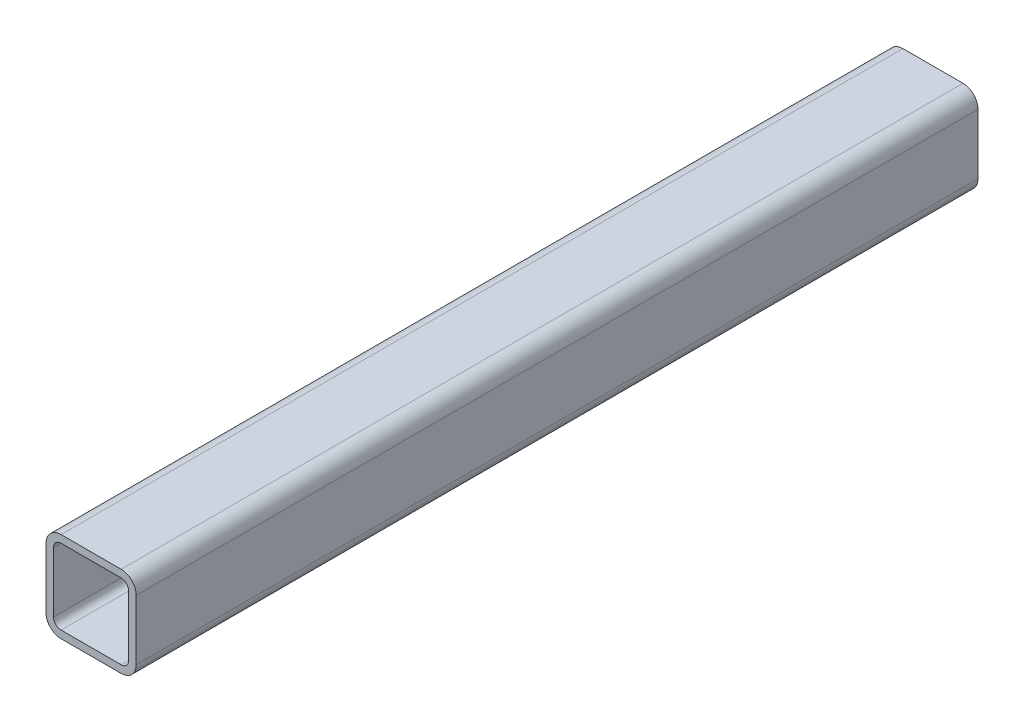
from build123d import *

# Parameters (mm, degrees)
BASE_EXTRUDE_THIN_DEPTH = 711.2


with BuildPart() as part:
    # Sketch1 → Base-Extrude-Thin (new body)
    with BuildSketch(Plane.XY):
        with BuildLine():
            Line((38.1, 25.4), (38.1, -25.4))
            ThreePointArc((38.1, -25.4), (34.380256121, -34.380256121), (25.4, -38.1))
            Line((25.4, -38.1), (-25.4, -38.1))
            ThreePointArc((-25.4, -38.1), (-34.380256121, -34.380256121), (-38.1, -25.4))
            Line((-38.1, -25.4), (-38.1, 25.4))
            ThreePointArc((-38.1, 25.4), (-34.380256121, 34.380256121), (-25.4, 38.1))
            Line((-25.4, 38.1), (25.4, 38.1))
            ThreePointArc((25.4, 38.1), (34.380256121, 34.380256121), (38.1, 25.4))
        make_face()
        with BuildLine():
            Line((31.75, 25.4), (31.75, -25.4))
            ThreePointArc((31.75, -25.4), (29.890128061, -29.890128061), (25.4, -31.75))
            Line((25.4, -31.75), (-25.4, -31.75))
            ThreePointArc((-25.4, -31.75), (-29.890128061, -29.890128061), (-31.75, -25.4))
            Line((-31.75, -25.4), (-31.75, 25.4))
            ThreePointArc((-31.75, 25.4), (-29.890128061, 29.890128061), (-25.4, 31.75))
            Line((-25.4, 31.75), (25.4, 31.75))
            ThreePointArc((25.4, 31.75), (29.890128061, 29.890128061), (31.75, 25.4))
        make_face(mode=Mode.SUBTRACT)
    extrude(amount=BASE_EXTRUDE_THIN_DEPTH)


solid = part.part
